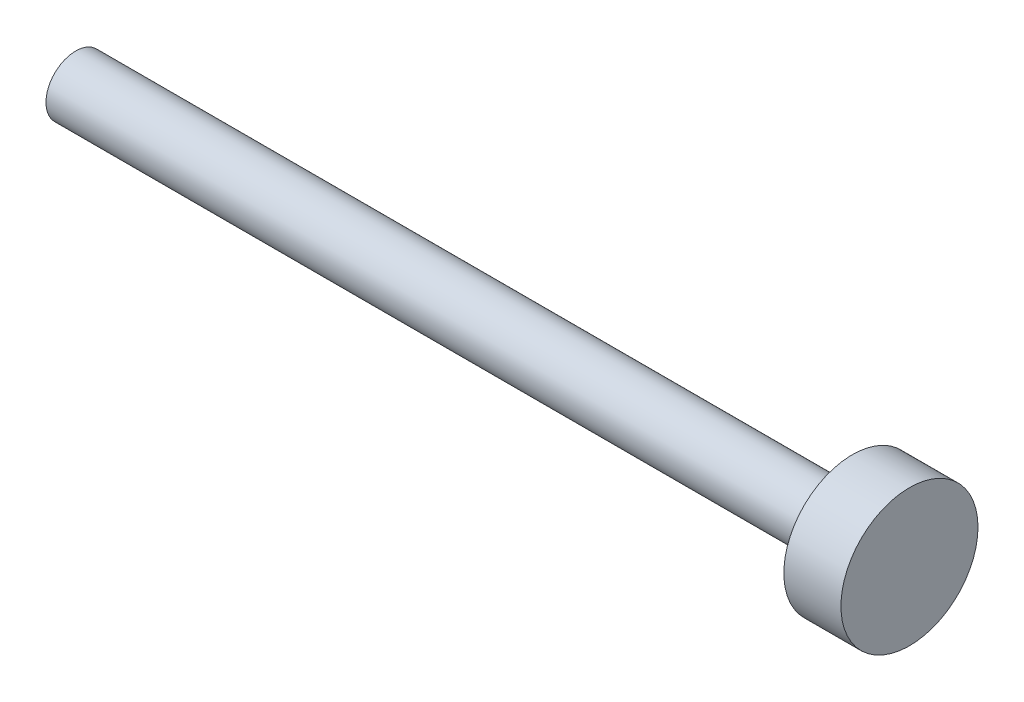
ISO-10303-21;
HEADER;
FILE_DESCRIPTION(('STEP AP214'),'2;1');
FILE_NAME('part.step','',(''),(''),'','','');
FILE_SCHEMA(('AUTOMOTIVE_DESIGN { 1 0 10303 214 1 1 1 1 }'));
ENDSEC;
DATA;
#1=APPLICATION_CONTEXT('core data for automotive mechanical design processes');
#2=APPLICATION_PROTOCOL_DEFINITION('international standard','automotive_design',2000,#1);
#3=PRODUCT_CONTEXT('',#1,'mechanical');
#4=PRODUCT('Part','Part','',(#3));
#5=PRODUCT_RELATED_PRODUCT_CATEGORY('part','',(#4));
#6=PRODUCT_DEFINITION_FORMATION('','',#4);
#7=PRODUCT_DEFINITION_CONTEXT('part definition',#1,'design');
#8=PRODUCT_DEFINITION('design','',#6,#7);
#9=PRODUCT_DEFINITION_SHAPE('','',#8);
#10=(LENGTH_UNIT() NAMED_UNIT(*) SI_UNIT(.MILLI.,.METRE.));
#11=(NAMED_UNIT(*) PLANE_ANGLE_UNIT() SI_UNIT($,.RADIAN.));
#12=(NAMED_UNIT(*) SI_UNIT($,.STERADIAN.) SOLID_ANGLE_UNIT());
#13=UNCERTAINTY_MEASURE_WITH_UNIT(LENGTH_MEASURE(1.E-05),#10,'distance_accuracy_value','');
#14=(GEOMETRIC_REPRESENTATION_CONTEXT(3) GLOBAL_UNCERTAINTY_ASSIGNED_CONTEXT((#13)) GLOBAL_UNIT_ASSIGNED_CONTEXT((#10,
#11,#12)) REPRESENTATION_CONTEXT('',''));
#15=CARTESIAN_POINT('',(0.,0.,0.));
#16=DIRECTION('',(0.,0.,1.));
#17=DIRECTION('',(1.,0.,0.));
#18=AXIS2_PLACEMENT_3D('',#15,#16,#17);
#19=CARTESIAN_POINT('',(43.18,0.,0.));
#20=DIRECTION('',(-1.,0.,0.));
#21=DIRECTION('',(0.,0.,1.));
#22=AXIS2_PLACEMENT_3D('',#19,#20,#21);
#23=CYLINDRICAL_SURFACE('',#22,1.651);
#24=CARTESIAN_POINT('',(43.18,0.,0.));
#25=DIRECTION('',(1.,0.,0.));
#26=DIRECTION('',(0.,0.,-1.));
#27=AXIS2_PLACEMENT_3D('',#24,#25,#26);
#28=CIRCLE('',#27,1.651);
#29=CARTESIAN_POINT('',(43.18,0.,-1.651));
#30=VERTEX_POINT('',#29);
#31=EDGE_CURVE('E10',#30,#30,#28,.T.);
#32=ORIENTED_EDGE('',*,*,#31,.F.);
#33=EDGE_LOOP('',(#32));
#34=FACE_BOUND('',#33,.T.);
#35=CARTESIAN_POINT('',(0.,0.,0.));
#36=DIRECTION('',(1.,0.,0.));
#37=DIRECTION('',(0.,0.,-1.));
#38=AXIS2_PLACEMENT_3D('',#35,#36,#37);
#39=CIRCLE('',#38,1.651);
#40=CARTESIAN_POINT('',(0.,0.,-1.651));
#41=VERTEX_POINT('',#40);
#42=EDGE_CURVE('E33',#41,#41,#39,.T.);
#43=ORIENTED_EDGE('',*,*,#42,.T.);
#44=EDGE_LOOP('',(#43));
#45=FACE_BOUND('',#44,.T.);
#46=ADVANCED_FACE('F30',(#34,#45),#23,.T.);
#47=CARTESIAN_POINT('',(0.,0.,0.));
#48=DIRECTION('',(1.,0.,0.));
#49=DIRECTION('',(0.,0.,-1.));
#50=AXIS2_PLACEMENT_3D('',#47,#48,#49);
#51=PLANE('',#50);
#52=ORIENTED_EDGE('',*,*,#42,.F.);
#53=EDGE_LOOP('',(#52));
#54=FACE_BOUND('',#53,.T.);
#55=ADVANCED_FACE('F58',(#54),#51,.F.);
#56=CARTESIAN_POINT('',(43.18,0.,0.));
#57=DIRECTION('',(1.,0.,0.));
#58=DIRECTION('',(0.,0.,-1.));
#59=AXIS2_PLACEMENT_3D('',#56,#57,#58);
#60=PLANE('',#59);
#61=CARTESIAN_POINT('',(43.18,0.,0.));
#62=DIRECTION('',(1.,0.,0.));
#63=DIRECTION('',(0.,0.,-1.));
#64=AXIS2_PLACEMENT_3D('',#61,#62,#63);
#65=CIRCLE('',#64,3.81);
#66=CARTESIAN_POINT('',(43.18,0.,-3.81));
#67=VERTEX_POINT('',#66);
#68=EDGE_CURVE('E42',#67,#67,#65,.T.);
#69=ORIENTED_EDGE('',*,*,#68,.F.);
#70=EDGE_LOOP('',(#69));
#71=FACE_BOUND('',#70,.T.);
#72=ORIENTED_EDGE('',*,*,#31,.T.);
#73=EDGE_LOOP('',(#72));
#74=FACE_BOUND('',#73,.T.);
#75=ADVANCED_FACE('F53',(#71,#74),#60,.F.);
#76=CARTESIAN_POINT('',(46.355,0.,0.));
#77=DIRECTION('',(-1.,0.,0.));
#78=DIRECTION('',(0.,0.,1.));
#79=AXIS2_PLACEMENT_3D('',#76,#77,#78);
#80=CYLINDRICAL_SURFACE('',#79,3.81);
#81=CARTESIAN_POINT('',(46.355,0.,0.));
#82=DIRECTION('',(1.,0.,0.));
#83=DIRECTION('',(0.,0.,-1.));
#84=AXIS2_PLACEMENT_3D('',#81,#82,#83);
#85=CIRCLE('',#84,3.81);
#86=CARTESIAN_POINT('',(46.355,0.,-3.81));
#87=VERTEX_POINT('',#86);
#88=EDGE_CURVE('E40',#87,#87,#85,.T.);
#89=ORIENTED_EDGE('',*,*,#88,.F.);
#90=EDGE_LOOP('',(#89));
#91=FACE_BOUND('',#90,.T.);
#92=ORIENTED_EDGE('',*,*,#68,.T.);
#93=EDGE_LOOP('',(#92));
#94=FACE_BOUND('',#93,.T.);
#95=ADVANCED_FACE('F50',(#91,#94),#80,.T.);
#96=CARTESIAN_POINT('',(46.355,0.,0.));
#97=DIRECTION('',(1.,0.,0.));
#98=DIRECTION('',(0.,0.,-1.));
#99=AXIS2_PLACEMENT_3D('',#96,#97,#98);
#100=PLANE('',#99);
#101=ORIENTED_EDGE('',*,*,#88,.T.);
#102=EDGE_LOOP('',(#101));
#103=FACE_BOUND('',#102,.T.);
#104=ADVANCED_FACE('F48',(#103),#100,.T.);
#105=CLOSED_SHELL('',(#46,#55,#75,#95,#104));
#106=MANIFOLD_SOLID_BREP('B2',#105);
#107=ADVANCED_BREP_SHAPE_REPRESENTATION('',(#18,#106),#14);
#108=SHAPE_DEFINITION_REPRESENTATION(#9,#107);
ENDSEC;
END-ISO-10303-21;
